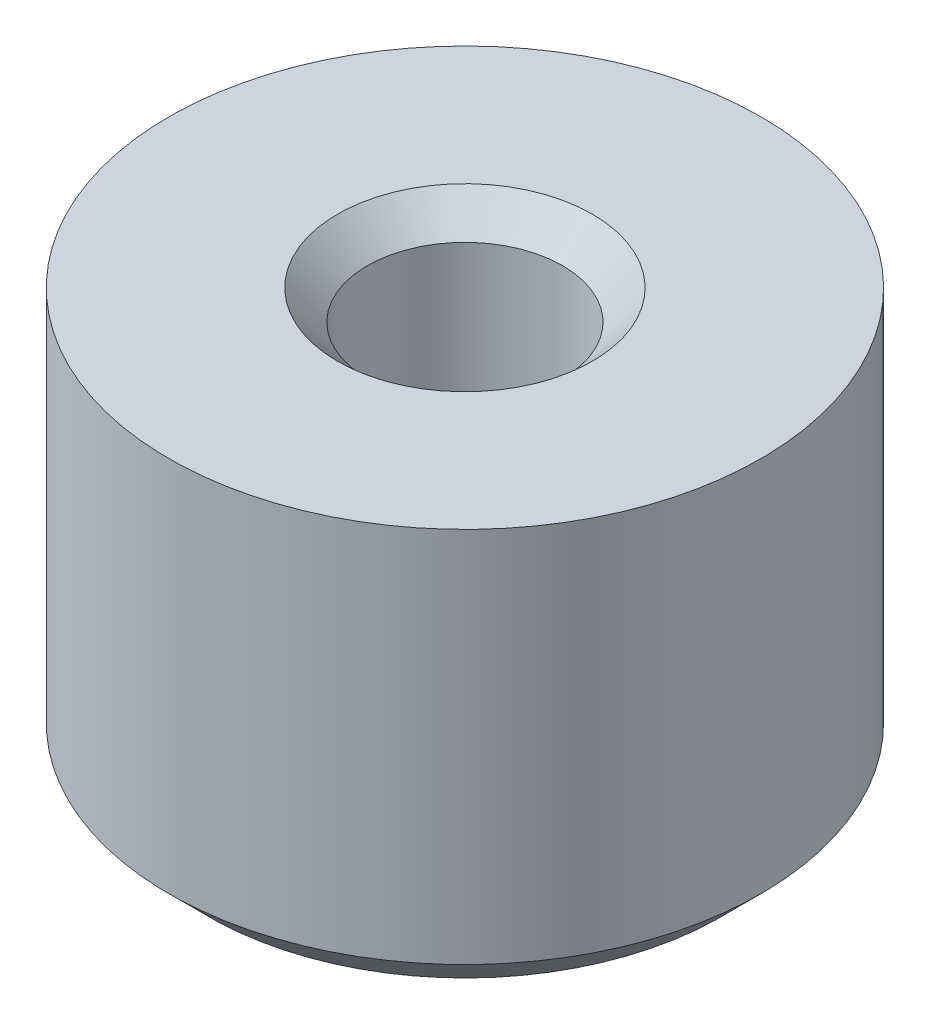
from build123d import *


with BuildPart() as part:
    # Esquisse1 → R_volution1 (revolve)
    with BuildSketch(Plane.XY, mode=Mode.PRIVATE) as r_volution1_sk:
        with BuildLine():
            Line((-7.89507676, 26), (-6.425, 26))
            Line((-6.425, 26), (-4.925, 24.5))
            Line((-4.925, 24.5), (-4.925, 11))
            ThreePointArc((-4.925, 11), (-4.046320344, 8.878679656), (-1.925, 8))
            Line((-1.925, 8), (-1.5, 8))
            Line((-1.5, 8), (-1.5, 5))
            Line((-1.5, 5), (-7.5, 5))
            Line((-7.5, 5), (-12.925, 5))
            Line((-12.925, 5), (-14.925, 7))
            Line((-14.925, 7), (-14.925, 26))
            Line((-14.925, 26), (-7.89507676, 26))
        make_face()
    revolve(r_volution1_sk.sketch.rotate(Axis((0, 0, 0), (0, 1, 0)), 270), axis=Axis((0, 0, 0), (0, 1, 0)))


solid = part.part
